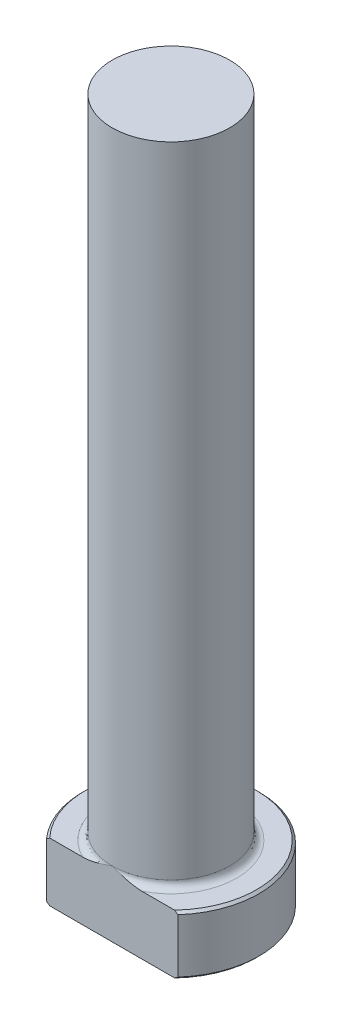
from build123d import *

# Parameters (mm, degrees)
CHAMFER1_SIZE = 0.254
FILLET1_R     = 0.762
KEY_DEPTH     = 78.381465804


with BuildPart() as part:
    # Sketch1 → Revolve1 (revolve)
    with BuildSketch(Plane.XY, mode=Mode.PRIVATE) as revolve1_sk:
        Polygon((0, 0), (-9.525, 0), (-9.525, 6.35), (-6.35, 6.35), (-6.35, 76.2), (0, 76.2), align=None)
    revolve(revolve1_sk.sketch.rotate(Axis((0, 259.958771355, 0), (0, -1, 0)), 270), axis=Axis((0, 259.958771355, 0), (0, -1, 0)))

    # Chamfer1
    chamfer1_edges = [part.edges().sort_by_distance(p)[0] for p in [
        (0, 6.35, -9.525),
        (0, 0, -9.525),
    ]]
    chamfer(chamfer1_edges, length=CHAMFER1_SIZE)

    # Fillet1
    fillet1_edges = [part.edges().sort_by_distance(p)[0] for p in [
        (0, 6.35, -6.35),
    ]]
    fillet(fillet1_edges, radius=FILLET1_R)

    # Sketch2 → Key (cut, through all)
    with BuildSketch(Plane(origin=(0, 0, 0), x_dir=(1, 0, 0), z_dir=(0, 1, 0))):
        with BuildLine():
            Line((-7.099515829, -6.35), (7.099515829, -6.35))
            ThreePointArc((7.099515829, -6.35), (0, -9.525), (-7.099515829, -6.35))
        make_face()
    extrude(amount=KEY_DEPTH, mode=Mode.SUBTRACT)


solid = part.part
